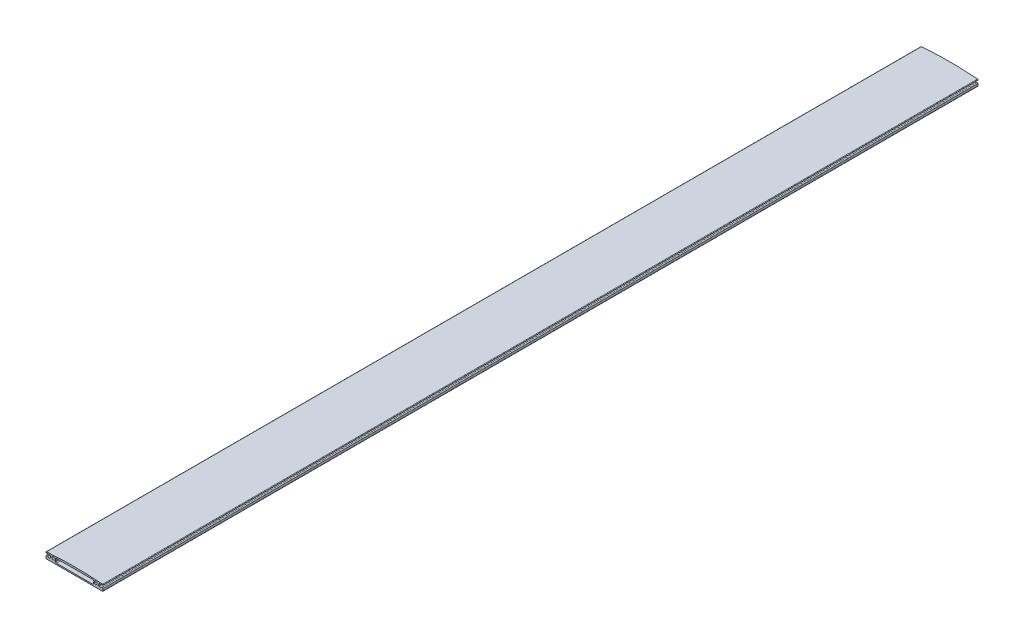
ISO-10303-21;
HEADER;
FILE_DESCRIPTION(('STEP AP214'),'2;1');
FILE_NAME('part.step','',(''),(''),'','','');
FILE_SCHEMA(('AUTOMOTIVE_DESIGN { 1 0 10303 214 1 1 1 1 }'));
ENDSEC;
DATA;
#1=APPLICATION_CONTEXT('core data for automotive mechanical design processes');
#2=APPLICATION_PROTOCOL_DEFINITION('international standard','automotive_design',2000,#1);
#3=PRODUCT_CONTEXT('',#1,'mechanical');
#4=PRODUCT('Part','Part','',(#3));
#5=PRODUCT_RELATED_PRODUCT_CATEGORY('part','',(#4));
#6=PRODUCT_DEFINITION_FORMATION('','',#4);
#7=PRODUCT_DEFINITION_CONTEXT('part definition',#1,'design');
#8=PRODUCT_DEFINITION('design','',#6,#7);
#9=PRODUCT_DEFINITION_SHAPE('','',#8);
#10=(LENGTH_UNIT() NAMED_UNIT(*) SI_UNIT(.MILLI.,.METRE.));
#11=(NAMED_UNIT(*) PLANE_ANGLE_UNIT() SI_UNIT($,.RADIAN.));
#12=(NAMED_UNIT(*) SI_UNIT($,.STERADIAN.) SOLID_ANGLE_UNIT());
#13=UNCERTAINTY_MEASURE_WITH_UNIT(LENGTH_MEASURE(1.E-05),#10,'distance_accuracy_value','');
#14=(GEOMETRIC_REPRESENTATION_CONTEXT(3) GLOBAL_UNCERTAINTY_ASSIGNED_CONTEXT((#13)) GLOBAL_UNIT_ASSIGNED_CONTEXT((#10,
#11,#12)) REPRESENTATION_CONTEXT('',''));
#15=CARTESIAN_POINT('',(0.,0.,0.));
#16=DIRECTION('',(0.,0.,1.));
#17=DIRECTION('',(1.,0.,0.));
#18=AXIS2_PLACEMENT_3D('',#15,#16,#17);
#19=CARTESIAN_POINT('',(32.4,-4.4,506.15));
#20=DIRECTION('',(0.,0.,-1.));
#21=DIRECTION('',(-1.,0.,0.));
#22=AXIS2_PLACEMENT_3D('',#19,#20,#21);
#23=PLANE('',#22);
#24=DIRECTION('',(1.,0.,0.));
#25=VECTOR('',#24,1.);
#26=CARTESIAN_POINT('',(-22.,-5.,506.15));
#27=LINE('',#26,#25);
#28=CARTESIAN_POINT('',(-32.4,-5.,506.15));
#29=VERTEX_POINT('',#28);
#30=CARTESIAN_POINT('',(32.4,-5.00000000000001,506.15));
#31=VERTEX_POINT('',#30);
#32=EDGE_CURVE('E317',#29,#31,#27,.T.);
#33=ORIENTED_EDGE('',*,*,#32,.T.);
#34=CARTESIAN_POINT('',(32.4,-4.4,506.15));
#35=DIRECTION('',(0.,0.,1.));
#36=DIRECTION('',(-1.,0.,0.));
#37=AXIS2_PLACEMENT_3D('',#34,#35,#36);
#38=CIRCLE('',#37,0.600000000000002);
#39=CARTESIAN_POINT('',(33.,-4.4,506.15));
#40=VERTEX_POINT('',#39);
#41=EDGE_CURVE('E319',#31,#40,#38,.T.);
#42=ORIENTED_EDGE('',*,*,#41,.T.);
#43=DIRECTION('',(0.,1.,0.));
#44=VECTOR('',#43,1.);
#45=CARTESIAN_POINT('',(33.,-4.4,506.15));
#46=LINE('',#45,#44);
#47=CARTESIAN_POINT('',(33.,-2.,506.15));
#48=VERTEX_POINT('',#47);
#49=EDGE_CURVE('E322',#40,#48,#46,.T.);
#50=ORIENTED_EDGE('',*,*,#49,.T.);
#51=CARTESIAN_POINT('',(32.25,-2.,506.15));
#52=DIRECTION('',(0.,0.,1.));
#53=DIRECTION('',(-1.,0.,0.));
#54=AXIS2_PLACEMENT_3D('',#51,#52,#53);
#55=CIRCLE('',#54,0.75);
#56=CARTESIAN_POINT('',(31.5626136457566,-1.7,506.15));
#57=VERTEX_POINT('',#56);
#58=EDGE_CURVE('E324',#48,#57,#55,.T.);
#59=ORIENTED_EDGE('',*,*,#58,.T.);
#60=CARTESIAN_POINT('',(31.104356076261,-1.5,506.15));
#61=DIRECTION('',(0.,0.,-1.));
#62=DIRECTION('',(-1.,0.,0.));
#63=AXIS2_PLACEMENT_3D('',#60,#61,#62);
#64=CIRCLE('',#63,0.500000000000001);
#65=CARTESIAN_POINT('',(31.104356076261,-2.,506.15));
#66=VERTEX_POINT('',#65);
#67=EDGE_CURVE('E326',#57,#66,#64,.T.);
#68=ORIENTED_EDGE('',*,*,#67,.T.);
#69=DIRECTION('',(-1.,0.,0.));
#70=VECTOR('',#69,1.);
#71=CARTESIAN_POINT('',(31.104356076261,-2.,506.15));
#72=LINE('',#71,#70);
#73=CARTESIAN_POINT('',(28.6,-2.,506.15));
#74=VERTEX_POINT('',#73);
#75=EDGE_CURVE('E328',#66,#74,#72,.T.);
#76=ORIENTED_EDGE('',*,*,#75,.T.);
#77=CARTESIAN_POINT('',(28.6,-1.4,506.15));
#78=DIRECTION('',(0.,0.,-1.));
#79=DIRECTION('',(1.,0.,0.));
#80=AXIS2_PLACEMENT_3D('',#77,#78,#79);
#81=CIRCLE('',#80,0.6);
#82=CARTESIAN_POINT('',(28.,-1.4,506.15));
#83=VERTEX_POINT('',#82);
#84=EDGE_CURVE('E330',#74,#83,#81,.T.);
#85=ORIENTED_EDGE('',*,*,#84,.T.);
#86=DIRECTION('',(0.,1.,0.));
#87=VECTOR('',#86,1.);
#88=CARTESIAN_POINT('',(28.,0.149999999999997,506.15));
#89=LINE('',#88,#87);
#90=CARTESIAN_POINT('',(28.,0.149999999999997,506.15));
#91=VERTEX_POINT('',#90);
#92=EDGE_CURVE('E332',#83,#91,#89,.T.);
#93=ORIENTED_EDGE('',*,*,#92,.T.);
#94=CARTESIAN_POINT('',(28.85,0.149999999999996,506.15));
#95=DIRECTION('',(0.,0.,-1.));
#96=DIRECTION('',(-1.,0.,0.));
#97=AXIS2_PLACEMENT_3D('',#94,#95,#96);
#98=CIRCLE('',#97,0.850000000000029);
#99=CARTESIAN_POINT('',(28.85,0.999999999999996,506.15));
#100=VERTEX_POINT('',#99);
#101=EDGE_CURVE('E334',#91,#100,#98,.T.);
#102=ORIENTED_EDGE('',*,*,#101,.T.);
#103=DIRECTION('',(1.,0.,0.));
#104=VECTOR('',#103,1.);
#105=CARTESIAN_POINT('',(32.3999999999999,0.999999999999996,506.15));
#106=LINE('',#105,#104);
#107=CARTESIAN_POINT('',(32.3999999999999,0.999999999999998,506.15));
#108=VERTEX_POINT('',#107);
#109=EDGE_CURVE('E336',#100,#108,#106,.T.);
#110=ORIENTED_EDGE('',*,*,#109,.T.);
#111=CARTESIAN_POINT('',(32.4,1.60048941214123,506.15));
#112=DIRECTION('',(0.,0.,1.));
#113=DIRECTION('',(1.,0.,0.));
#114=AXIS2_PLACEMENT_3D('',#111,#112,#113);
#115=CIRCLE('',#114,0.600489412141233);
#116=CARTESIAN_POINT('',(32.4484386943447,2.19902197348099,506.15));
#117=VERTEX_POINT('',#116);
#118=EDGE_CURVE('E338',#108,#117,#115,.T.);
#119=ORIENTED_EDGE('',*,*,#118,.T.);
#120=CARTESIAN_POINT('',(0.,-398.75,506.15));
#121=DIRECTION('',(0.,0.,1.));
#122=DIRECTION('',(-1.,0.,0.));
#123=AXIS2_PLACEMENT_3D('',#120,#121,#122);
#124=CIRCLE('',#123,402.259890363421);
#125=CARTESIAN_POINT('',(-32.4484386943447,2.19902197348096,506.15));
#126=VERTEX_POINT('',#125);
#127=EDGE_CURVE('E340',#117,#126,#124,.T.);
#128=ORIENTED_EDGE('',*,*,#127,.T.);
#129=CARTESIAN_POINT('',(-32.4,1.60048941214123,506.15));
#130=DIRECTION('',(0.,0.,1.));
#131=DIRECTION('',(-1.,0.,0.));
#132=AXIS2_PLACEMENT_3D('',#129,#130,#131);
#133=CIRCLE('',#132,0.600489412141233);
#134=CARTESIAN_POINT('',(-32.3999999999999,0.999999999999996,506.15));
#135=VERTEX_POINT('',#134);
#136=EDGE_CURVE('E342',#126,#135,#133,.T.);
#137=ORIENTED_EDGE('',*,*,#136,.T.);
#138=DIRECTION('',(1.,0.,0.));
#139=VECTOR('',#138,1.);
#140=CARTESIAN_POINT('',(-32.3999999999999,0.999999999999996,506.15));
#141=LINE('',#140,#139);
#142=CARTESIAN_POINT('',(-28.85,1.00000000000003,506.15));
#143=VERTEX_POINT('',#142);
#144=EDGE_CURVE('E344',#135,#143,#141,.T.);
#145=ORIENTED_EDGE('',*,*,#144,.T.);
#146=CARTESIAN_POINT('',(-28.85,0.149999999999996,506.15));
#147=DIRECTION('',(0.,0.,-1.));
#148=DIRECTION('',(1.,0.,0.));
#149=AXIS2_PLACEMENT_3D('',#146,#147,#148);
#150=CIRCLE('',#149,0.850000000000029);
#151=CARTESIAN_POINT('',(-28.,0.149999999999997,506.15));
#152=VERTEX_POINT('',#151);
#153=EDGE_CURVE('E346',#143,#152,#150,.T.);
#154=ORIENTED_EDGE('',*,*,#153,.T.);
#155=DIRECTION('',(0.,-1.,0.));
#156=VECTOR('',#155,1.);
#157=CARTESIAN_POINT('',(-28.,0.149999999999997,506.15));
#158=LINE('',#157,#156);
#159=CARTESIAN_POINT('',(-28.,-1.4,506.15));
#160=VERTEX_POINT('',#159);
#161=EDGE_CURVE('E348',#152,#160,#158,.T.);
#162=ORIENTED_EDGE('',*,*,#161,.T.);
#163=CARTESIAN_POINT('',(-28.6,-1.4,506.15));
#164=DIRECTION('',(0.,0.,-1.));
#165=DIRECTION('',(-1.,0.,0.));
#166=AXIS2_PLACEMENT_3D('',#163,#164,#165);
#167=CIRCLE('',#166,0.6);
#168=CARTESIAN_POINT('',(-28.6,-2.,506.15));
#169=VERTEX_POINT('',#168);
#170=EDGE_CURVE('E350',#160,#169,#167,.T.);
#171=ORIENTED_EDGE('',*,*,#170,.T.);
#172=DIRECTION('',(-1.,0.,0.));
#173=VECTOR('',#172,1.);
#174=CARTESIAN_POINT('',(-31.104356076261,-2.,506.15));
#175=LINE('',#174,#173);
#176=CARTESIAN_POINT('',(-31.104356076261,-2.,506.15));
#177=VERTEX_POINT('',#176);
#178=EDGE_CURVE('E352',#169,#177,#175,.T.);
#179=ORIENTED_EDGE('',*,*,#178,.T.);
#180=CARTESIAN_POINT('',(-31.104356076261,-1.5,506.15));
#181=DIRECTION('',(0.,0.,-1.));
#182=DIRECTION('',(1.,0.,0.));
#183=AXIS2_PLACEMENT_3D('',#180,#181,#182);
#184=CIRCLE('',#183,0.500000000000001);
#185=CARTESIAN_POINT('',(-31.5626136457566,-1.7,506.15));
#186=VERTEX_POINT('',#185);
#187=EDGE_CURVE('E354',#177,#186,#184,.T.);
#188=ORIENTED_EDGE('',*,*,#187,.T.);
#189=CARTESIAN_POINT('',(-32.25,-2.,506.15));
#190=DIRECTION('',(0.,0.,1.));
#191=DIRECTION('',(1.,0.,0.));
#192=AXIS2_PLACEMENT_3D('',#189,#190,#191);
#193=CIRCLE('',#192,0.75);
#194=CARTESIAN_POINT('',(-33.,-2.,506.15));
#195=VERTEX_POINT('',#194);
#196=EDGE_CURVE('E356',#186,#195,#193,.T.);
#197=ORIENTED_EDGE('',*,*,#196,.T.);
#198=DIRECTION('',(0.,-1.,0.));
#199=VECTOR('',#198,1.);
#200=CARTESIAN_POINT('',(-33.,-4.4,506.15));
#201=LINE('',#200,#199);
#202=CARTESIAN_POINT('',(-33.,-4.4,506.15));
#203=VERTEX_POINT('',#202);
#204=EDGE_CURVE('E358',#195,#203,#201,.T.);
#205=ORIENTED_EDGE('',*,*,#204,.T.);
#206=CARTESIAN_POINT('',(-32.4,-4.4,506.15));
#207=DIRECTION('',(0.,0.,1.));
#208=DIRECTION('',(1.,0.,0.));
#209=AXIS2_PLACEMENT_3D('',#206,#207,#208);
#210=CIRCLE('',#209,0.600000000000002);
#211=EDGE_CURVE('E360',#203,#29,#210,.T.);
#212=ORIENTED_EDGE('',*,*,#211,.T.);
#213=EDGE_LOOP('',(#33,#42,#50,#59,#68,#76,#85,#93,#102,#110,#119,#128,#137,#145,#154,#162,#171,
#179,#188,#197,#205,#212));
#214=FACE_BOUND('',#213,.T.);
#215=DIRECTION('',(0.,-1.,0.));
#216=VECTOR('',#215,1.);
#217=CARTESIAN_POINT('',(-22.,-2.50000000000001,506.15));
#218=LINE('',#217,#216);
#219=CARTESIAN_POINT('',(-22.,-1.,506.15));
#220=VERTEX_POINT('',#219);
#221=CARTESIAN_POINT('',(-22.,-2.50000000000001,506.15));
#222=VERTEX_POINT('',#221);
#223=EDGE_CURVE('E916',#220,#222,#218,.T.);
#224=ORIENTED_EDGE('',*,*,#223,.F.);
#225=DIRECTION('',(1.,0.,0.));
#226=VECTOR('',#225,1.);
#227=CARTESIAN_POINT('',(-23.0853950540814,-1.,506.15));
#228=LINE('',#227,#226);
#229=CARTESIAN_POINT('',(-23.0853950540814,-1.,506.15));
#230=VERTEX_POINT('',#229);
#231=EDGE_CURVE('E31',#230,#220,#228,.T.);
#232=ORIENTED_EDGE('',*,*,#231,.F.);
#233=CARTESIAN_POINT('',(-24.4987244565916,-0.250000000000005,506.15));
#234=DIRECTION('',(0.,0.,1.));
#235=DIRECTION('',(1.,0.,0.));
#236=AXIS2_PLACEMENT_3D('',#233,#234,#235);
#237=CIRCLE('',#236,1.6);
#238=CARTESIAN_POINT('',(-23.0853950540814,0.499999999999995,506.15));
#239=VERTEX_POINT('',#238);
#240=EDGE_CURVE('E909',#239,#230,#237,.T.);
#241=ORIENTED_EDGE('',*,*,#240,.F.);
#242=DIRECTION('',(-1.,0.,0.));
#243=VECTOR('',#242,1.);
#244=CARTESIAN_POINT('',(-23.0853950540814,0.499999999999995,506.15));
#245=LINE('',#244,#243);
#246=CARTESIAN_POINT('',(-21.9682458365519,0.499999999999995,506.15));
#247=VERTEX_POINT('',#246);
#248=EDGE_CURVE('E912',#247,#239,#245,.T.);
#249=ORIENTED_EDGE('',*,*,#248,.F.);
#250=CARTESIAN_POINT('',(-21.,0.249999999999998,506.15));
#251=DIRECTION('',(0.,0.,1.));
#252=DIRECTION('',(-1.,0.,0.));
#253=AXIS2_PLACEMENT_3D('',#250,#251,#252);
#254=CIRCLE('',#253,1.);
#255=CARTESIAN_POINT('',(-21.,1.25,506.15));
#256=VERTEX_POINT('',#255);
#257=EDGE_CURVE('E268',#256,#247,#254,.T.);
#258=ORIENTED_EDGE('',*,*,#257,.F.);
#259=DIRECTION('',(-1.,0.,0.));
#260=VECTOR('',#259,1.);
#261=CARTESIAN_POINT('',(-21.,1.25,506.15));
#262=LINE('',#261,#260);
#263=CARTESIAN_POINT('',(21.,1.25,506.15));
#264=VERTEX_POINT('',#263);
#265=EDGE_CURVE('E285',#264,#256,#262,.T.);
#266=ORIENTED_EDGE('',*,*,#265,.F.);
#267=CARTESIAN_POINT('',(21.,0.249999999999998,506.15));
#268=DIRECTION('',(0.,0.,1.));
#269=DIRECTION('',(1.,0.,0.));
#270=AXIS2_PLACEMENT_3D('',#267,#268,#269);
#271=CIRCLE('',#270,1.);
#272=CARTESIAN_POINT('',(21.9682458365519,0.499999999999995,506.15));
#273=VERTEX_POINT('',#272);
#274=EDGE_CURVE('E955',#273,#264,#271,.T.);
#275=ORIENTED_EDGE('',*,*,#274,.F.);
#276=DIRECTION('',(-1.,0.,0.));
#277=VECTOR('',#276,1.);
#278=CARTESIAN_POINT('',(23.0853950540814,0.499999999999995,506.15));
#279=LINE('',#278,#277);
#280=CARTESIAN_POINT('',(23.0853950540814,0.499999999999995,506.15));
#281=VERTEX_POINT('',#280);
#282=EDGE_CURVE('E39',#281,#273,#279,.T.);
#283=ORIENTED_EDGE('',*,*,#282,.F.);
#284=CARTESIAN_POINT('',(24.4987244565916,-0.250000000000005,506.15));
#285=DIRECTION('',(0.,0.,1.));
#286=DIRECTION('',(-1.,0.,0.));
#287=AXIS2_PLACEMENT_3D('',#284,#285,#286);
#288=CIRCLE('',#287,1.6);
#289=CARTESIAN_POINT('',(23.0853950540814,-1.00000000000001,506.15));
#290=VERTEX_POINT('',#289);
#291=EDGE_CURVE('E937',#290,#281,#288,.T.);
#292=ORIENTED_EDGE('',*,*,#291,.F.);
#293=DIRECTION('',(1.,0.,0.));
#294=VECTOR('',#293,1.);
#295=CARTESIAN_POINT('',(23.0853950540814,-1.,506.15));
#296=LINE('',#295,#294);
#297=CARTESIAN_POINT('',(22.,-1.,506.15));
#298=VERTEX_POINT('',#297);
#299=EDGE_CURVE('E922',#298,#290,#296,.T.);
#300=ORIENTED_EDGE('',*,*,#299,.F.);
#301=DIRECTION('',(0.,1.,0.));
#302=VECTOR('',#301,1.);
#303=CARTESIAN_POINT('',(22.,-2.5,506.15));
#304=LINE('',#303,#302);
#305=CARTESIAN_POINT('',(22.,-2.5,506.15));
#306=VERTEX_POINT('',#305);
#307=EDGE_CURVE('E953',#306,#298,#304,.T.);
#308=ORIENTED_EDGE('',*,*,#307,.F.);
#309=CARTESIAN_POINT('',(21.,-2.5,506.15));
#310=DIRECTION('',(0.,0.,1.));
#311=DIRECTION('',(-1.,0.,0.));
#312=AXIS2_PLACEMENT_3D('',#309,#310,#311);
#313=CIRCLE('',#312,1.);
#314=CARTESIAN_POINT('',(21.,-3.5,506.15));
#315=VERTEX_POINT('',#314);
#316=EDGE_CURVE('E951',#315,#306,#313,.T.);
#317=ORIENTED_EDGE('',*,*,#316,.F.);
#318=DIRECTION('',(1.,0.,0.));
#319=VECTOR('',#318,1.);
#320=CARTESIAN_POINT('',(21.,-3.5,506.15));
#321=LINE('',#320,#319);
#322=CARTESIAN_POINT('',(-21.,-3.50000000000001,506.15));
#323=VERTEX_POINT('',#322);
#324=EDGE_CURVE('E949',#323,#315,#321,.T.);
#325=ORIENTED_EDGE('',*,*,#324,.F.);
#326=CARTESIAN_POINT('',(-21.,-2.50000000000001,506.15));
#327=DIRECTION('',(0.,0.,1.));
#328=DIRECTION('',(-1.,0.,0.));
#329=AXIS2_PLACEMENT_3D('',#326,#327,#328);
#330=CIRCLE('',#329,1.);
#331=EDGE_CURVE('E947',#222,#323,#330,.T.);
#332=ORIENTED_EDGE('',*,*,#331,.F.);
#333=EDGE_LOOP('',(#224,#232,#241,#249,#258,#266,#275,#283,#292,#300,#308,#317,#325,#332));
#334=FACE_BOUND('',#333,.T.);
#335=ADVANCED_FACE('F16',(#214,#334),#23,.F.);
#336=CARTESIAN_POINT('',(32.4,-4.4,-506.15));
#337=DIRECTION('',(0.,0.,-1.));
#338=DIRECTION('',(-1.,0.,0.));
#339=AXIS2_PLACEMENT_3D('',#336,#337,#338);
#340=PLANE('',#339);
#341=DIRECTION('',(1.,0.,0.));
#342=VECTOR('',#341,1.);
#343=CARTESIAN_POINT('',(-23.0853950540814,-1.,-506.15));
#344=LINE('',#343,#342);
#345=CARTESIAN_POINT('',(-23.0853950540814,-1.,-506.15));
#346=VERTEX_POINT('',#345);
#347=CARTESIAN_POINT('',(-22.,-1.,-506.15));
#348=VERTEX_POINT('',#347);
#349=EDGE_CURVE('E269',#346,#348,#344,.T.);
#350=ORIENTED_EDGE('',*,*,#349,.T.);
#351=DIRECTION('',(0.,-1.,0.));
#352=VECTOR('',#351,1.);
#353=CARTESIAN_POINT('',(-22.,-2.50000000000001,-506.15));
#354=LINE('',#353,#352);
#355=CARTESIAN_POINT('',(-22.,-2.50000000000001,-506.15));
#356=VERTEX_POINT('',#355);
#357=EDGE_CURVE('E277',#348,#356,#354,.T.);
#358=ORIENTED_EDGE('',*,*,#357,.T.);
#359=CARTESIAN_POINT('',(-21.,-2.50000000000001,-506.15));
#360=DIRECTION('',(0.,0.,1.));
#361=DIRECTION('',(-1.,0.,0.));
#362=AXIS2_PLACEMENT_3D('',#359,#360,#361);
#363=CIRCLE('',#362,1.);
#364=CARTESIAN_POINT('',(-21.,-3.50000000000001,-506.15));
#365=VERTEX_POINT('',#364);
#366=EDGE_CURVE('E280',#356,#365,#363,.T.);
#367=ORIENTED_EDGE('',*,*,#366,.T.);
#368=DIRECTION('',(1.,0.,0.));
#369=VECTOR('',#368,1.);
#370=CARTESIAN_POINT('',(21.,-3.5,-506.15));
#371=LINE('',#370,#369);
#372=CARTESIAN_POINT('',(21.,-3.5,-506.15));
#373=VERTEX_POINT('',#372);
#374=EDGE_CURVE('E290',#365,#373,#371,.T.);
#375=ORIENTED_EDGE('',*,*,#374,.T.);
#376=CARTESIAN_POINT('',(21.,-2.5,-506.15));
#377=DIRECTION('',(0.,0.,1.));
#378=DIRECTION('',(-1.,0.,0.));
#379=AXIS2_PLACEMENT_3D('',#376,#377,#378);
#380=CIRCLE('',#379,1.);
#381=CARTESIAN_POINT('',(22.,-2.5,-506.15));
#382=VERTEX_POINT('',#381);
#383=EDGE_CURVE('E293',#373,#382,#380,.T.);
#384=ORIENTED_EDGE('',*,*,#383,.T.);
#385=DIRECTION('',(0.,1.,0.));
#386=VECTOR('',#385,1.);
#387=CARTESIAN_POINT('',(22.,-2.5,-506.15));
#388=LINE('',#387,#386);
#389=CARTESIAN_POINT('',(22.,-1.,-506.15));
#390=VERTEX_POINT('',#389);
#391=EDGE_CURVE('E296',#382,#390,#388,.T.);
#392=ORIENTED_EDGE('',*,*,#391,.T.);
#393=DIRECTION('',(1.,0.,0.));
#394=VECTOR('',#393,1.);
#395=CARTESIAN_POINT('',(23.0853950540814,-1.,-506.15));
#396=LINE('',#395,#394);
#397=CARTESIAN_POINT('',(23.0853950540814,-1.00000000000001,-506.15));
#398=VERTEX_POINT('',#397);
#399=EDGE_CURVE('E925',#390,#398,#396,.T.);
#400=ORIENTED_EDGE('',*,*,#399,.T.);
#401=CARTESIAN_POINT('',(24.4987244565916,-0.250000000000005,-506.15));
#402=DIRECTION('',(0.,0.,1.));
#403=DIRECTION('',(-1.,0.,0.));
#404=AXIS2_PLACEMENT_3D('',#401,#402,#403);
#405=CIRCLE('',#404,1.6);
#406=CARTESIAN_POINT('',(23.0853950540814,0.499999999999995,-506.15));
#407=VERTEX_POINT('',#406);
#408=EDGE_CURVE('E928',#398,#407,#405,.T.);
#409=ORIENTED_EDGE('',*,*,#408,.T.);
#410=DIRECTION('',(-1.,0.,0.));
#411=VECTOR('',#410,1.);
#412=CARTESIAN_POINT('',(23.0853950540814,0.499999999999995,-506.15));
#413=LINE('',#412,#411);
#414=CARTESIAN_POINT('',(21.9682458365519,0.499999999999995,-506.15));
#415=VERTEX_POINT('',#414);
#416=EDGE_CURVE('E931',#407,#415,#413,.T.);
#417=ORIENTED_EDGE('',*,*,#416,.T.);
#418=CARTESIAN_POINT('',(21.,0.249999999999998,-506.15));
#419=DIRECTION('',(0.,0.,1.));
#420=DIRECTION('',(1.,0.,0.));
#421=AXIS2_PLACEMENT_3D('',#418,#419,#420);
#422=CIRCLE('',#421,1.);
#423=CARTESIAN_POINT('',(21.,1.25,-506.15));
#424=VERTEX_POINT('',#423);
#425=EDGE_CURVE('E299',#415,#424,#422,.T.);
#426=ORIENTED_EDGE('',*,*,#425,.T.);
#427=DIRECTION('',(-1.,0.,0.));
#428=VECTOR('',#427,1.);
#429=CARTESIAN_POINT('',(-21.,1.25,-506.15));
#430=LINE('',#429,#428);
#431=CARTESIAN_POINT('',(-21.,1.25,-506.15));
#432=VERTEX_POINT('',#431);
#433=EDGE_CURVE('E276',#424,#432,#430,.T.);
#434=ORIENTED_EDGE('',*,*,#433,.T.);
#435=CARTESIAN_POINT('',(-21.,0.249999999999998,-506.15));
#436=DIRECTION('',(0.,0.,1.));
#437=DIRECTION('',(-1.,0.,0.));
#438=AXIS2_PLACEMENT_3D('',#435,#436,#437);
#439=CIRCLE('',#438,1.);
#440=CARTESIAN_POINT('',(-21.9682458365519,0.499999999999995,-506.15));
#441=VERTEX_POINT('',#440);
#442=EDGE_CURVE('E265',#432,#441,#439,.T.);
#443=ORIENTED_EDGE('',*,*,#442,.T.);
#444=DIRECTION('',(-1.,0.,0.));
#445=VECTOR('',#444,1.);
#446=CARTESIAN_POINT('',(-23.0853950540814,0.499999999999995,-506.15));
#447=LINE('',#446,#445);
#448=CARTESIAN_POINT('',(-23.0853950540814,0.499999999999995,-506.15));
#449=VERTEX_POINT('',#448);
#450=EDGE_CURVE('E248',#441,#449,#447,.T.);
#451=ORIENTED_EDGE('',*,*,#450,.T.);
#452=CARTESIAN_POINT('',(-24.4987244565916,-0.250000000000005,-506.15));
#453=DIRECTION('',(0.,0.,1.));
#454=DIRECTION('',(1.,0.,0.));
#455=AXIS2_PLACEMENT_3D('',#452,#453,#454);
#456=CIRCLE('',#455,1.6);
#457=EDGE_CURVE('E259',#449,#346,#456,.T.);
#458=ORIENTED_EDGE('',*,*,#457,.T.);
#459=EDGE_LOOP('',(#350,#358,#367,#375,#384,#392,#400,#409,#417,#426,#434,#443,#451,#458));
#460=FACE_BOUND('',#459,.T.);
#461=CARTESIAN_POINT('',(32.4,-4.4,-506.15));
#462=DIRECTION('',(0.,0.,1.));
#463=DIRECTION('',(-1.,0.,0.));
#464=AXIS2_PLACEMENT_3D('',#461,#462,#463);
#465=CIRCLE('',#464,0.600000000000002);
#466=CARTESIAN_POINT('',(32.4,-5.00000000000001,-506.15));
#467=VERTEX_POINT('',#466);
#468=CARTESIAN_POINT('',(33.,-4.4,-506.15));
#469=VERTEX_POINT('',#468);
#470=EDGE_CURVE('E316',#467,#469,#465,.T.);
#471=ORIENTED_EDGE('',*,*,#470,.F.);
#472=DIRECTION('',(1.,0.,0.));
#473=VECTOR('',#472,1.);
#474=CARTESIAN_POINT('',(-22.,-5.,-506.15));
#475=LINE('',#474,#473);
#476=CARTESIAN_POINT('',(-32.4,-5.,-506.15));
#477=VERTEX_POINT('',#476);
#478=EDGE_CURVE('E320',#477,#467,#475,.T.);
#479=ORIENTED_EDGE('',*,*,#478,.F.);
#480=CARTESIAN_POINT('',(-32.4,-4.4,-506.15));
#481=DIRECTION('',(0.,0.,1.));
#482=DIRECTION('',(1.,0.,0.));
#483=AXIS2_PLACEMENT_3D('',#480,#481,#482);
#484=CIRCLE('',#483,0.600000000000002);
#485=CARTESIAN_POINT('',(-33.,-4.4,-506.15));
#486=VERTEX_POINT('',#485);
#487=EDGE_CURVE('E403',#486,#477,#484,.T.);
#488=ORIENTED_EDGE('',*,*,#487,.F.);
#489=DIRECTION('',(0.,-1.,0.));
#490=VECTOR('',#489,1.);
#491=CARTESIAN_POINT('',(-33.,-4.4,-506.15));
#492=LINE('',#491,#490);
#493=CARTESIAN_POINT('',(-33.,-2.,-506.15));
#494=VERTEX_POINT('',#493);
#495=EDGE_CURVE('E401',#494,#486,#492,.T.);
#496=ORIENTED_EDGE('',*,*,#495,.F.);
#497=CARTESIAN_POINT('',(-32.25,-2.,-506.15));
#498=DIRECTION('',(0.,0.,1.));
#499=DIRECTION('',(1.,0.,0.));
#500=AXIS2_PLACEMENT_3D('',#497,#498,#499);
#501=CIRCLE('',#500,0.75);
#502=CARTESIAN_POINT('',(-31.5626136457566,-1.7,-506.15));
#503=VERTEX_POINT('',#502);
#504=EDGE_CURVE('E399',#503,#494,#501,.T.);
#505=ORIENTED_EDGE('',*,*,#504,.F.);
#506=CARTESIAN_POINT('',(-31.104356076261,-1.5,-506.15));
#507=DIRECTION('',(0.,0.,-1.));
#508=DIRECTION('',(1.,0.,0.));
#509=AXIS2_PLACEMENT_3D('',#506,#507,#508);
#510=CIRCLE('',#509,0.500000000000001);
#511=CARTESIAN_POINT('',(-31.104356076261,-2.,-506.15));
#512=VERTEX_POINT('',#511);
#513=EDGE_CURVE('E397',#512,#503,#510,.T.);
#514=ORIENTED_EDGE('',*,*,#513,.F.);
#515=DIRECTION('',(-1.,0.,0.));
#516=VECTOR('',#515,1.);
#517=CARTESIAN_POINT('',(-31.104356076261,-2.,-506.15));
#518=LINE('',#517,#516);
#519=CARTESIAN_POINT('',(-28.6,-2.,-506.15));
#520=VERTEX_POINT('',#519);
#521=EDGE_CURVE('E395',#520,#512,#518,.T.);
#522=ORIENTED_EDGE('',*,*,#521,.F.);
#523=CARTESIAN_POINT('',(-28.6,-1.4,-506.15));
#524=DIRECTION('',(0.,0.,-1.));
#525=DIRECTION('',(-1.,0.,0.));
#526=AXIS2_PLACEMENT_3D('',#523,#524,#525);
#527=CIRCLE('',#526,0.6);
#528=CARTESIAN_POINT('',(-28.,-1.4,-506.15));
#529=VERTEX_POINT('',#528);
#530=EDGE_CURVE('E393',#529,#520,#527,.T.);
#531=ORIENTED_EDGE('',*,*,#530,.F.);
#532=DIRECTION('',(0.,-1.,0.));
#533=VECTOR('',#532,1.);
#534=CARTESIAN_POINT('',(-28.,0.149999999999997,-506.15));
#535=LINE('',#534,#533);
#536=CARTESIAN_POINT('',(-28.,0.149999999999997,-506.15));
#537=VERTEX_POINT('',#536);
#538=EDGE_CURVE('E391',#537,#529,#535,.T.);
#539=ORIENTED_EDGE('',*,*,#538,.F.);
#540=CARTESIAN_POINT('',(-28.85,0.149999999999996,-506.15));
#541=DIRECTION('',(0.,0.,-1.));
#542=DIRECTION('',(1.,0.,0.));
#543=AXIS2_PLACEMENT_3D('',#540,#541,#542);
#544=CIRCLE('',#543,0.850000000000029);
#545=CARTESIAN_POINT('',(-28.85,1.00000000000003,-506.15));
#546=VERTEX_POINT('',#545);
#547=EDGE_CURVE('E389',#546,#537,#544,.T.);
#548=ORIENTED_EDGE('',*,*,#547,.F.);
#549=DIRECTION('',(1.,0.,0.));
#550=VECTOR('',#549,1.);
#551=CARTESIAN_POINT('',(-32.3999999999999,0.999999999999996,-506.15));
#552=LINE('',#551,#550);
#553=CARTESIAN_POINT('',(-32.3999999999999,0.999999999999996,-506.15));
#554=VERTEX_POINT('',#553);
#555=EDGE_CURVE('E387',#554,#546,#552,.T.);
#556=ORIENTED_EDGE('',*,*,#555,.F.);
#557=CARTESIAN_POINT('',(-32.4,1.60048941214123,-506.15));
#558=DIRECTION('',(0.,0.,1.));
#559=DIRECTION('',(-1.,0.,0.));
#560=AXIS2_PLACEMENT_3D('',#557,#558,#559);
#561=CIRCLE('',#560,0.600489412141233);
#562=CARTESIAN_POINT('',(-32.4484386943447,2.19902197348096,-506.15));
#563=VERTEX_POINT('',#562);
#564=EDGE_CURVE('E385',#563,#554,#561,.T.);
#565=ORIENTED_EDGE('',*,*,#564,.F.);
#566=CARTESIAN_POINT('',(0.,-398.75,-506.15));
#567=DIRECTION('',(0.,0.,1.));
#568=DIRECTION('',(-1.,0.,0.));
#569=AXIS2_PLACEMENT_3D('',#566,#567,#568);
#570=CIRCLE('',#569,402.259890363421);
#571=CARTESIAN_POINT('',(32.4484386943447,2.19902197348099,-506.15));
#572=VERTEX_POINT('',#571);
#573=EDGE_CURVE('E383',#572,#563,#570,.T.);
#574=ORIENTED_EDGE('',*,*,#573,.F.);
#575=CARTESIAN_POINT('',(32.4,1.60048941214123,-506.15));
#576=DIRECTION('',(0.,0.,1.));
#577=DIRECTION('',(1.,0.,0.));
#578=AXIS2_PLACEMENT_3D('',#575,#576,#577);
#579=CIRCLE('',#578,0.600489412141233);
#580=CARTESIAN_POINT('',(32.3999999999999,0.999999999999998,-506.15));
#581=VERTEX_POINT('',#580);
#582=EDGE_CURVE('E381',#581,#572,#579,.T.);
#583=ORIENTED_EDGE('',*,*,#582,.F.);
#584=DIRECTION('',(1.,0.,0.));
#585=VECTOR('',#584,1.);
#586=CARTESIAN_POINT('',(32.3999999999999,0.999999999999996,-506.15));
#587=LINE('',#586,#585);
#588=CARTESIAN_POINT('',(28.85,0.999999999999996,-506.15));
#589=VERTEX_POINT('',#588);
#590=EDGE_CURVE('E379',#589,#581,#587,.T.);
#591=ORIENTED_EDGE('',*,*,#590,.F.);
#592=CARTESIAN_POINT('',(28.85,0.149999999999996,-506.15));
#593=DIRECTION('',(0.,0.,-1.));
#594=DIRECTION('',(-1.,0.,0.));
#595=AXIS2_PLACEMENT_3D('',#592,#593,#594);
#596=CIRCLE('',#595,0.850000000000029);
#597=CARTESIAN_POINT('',(28.,0.149999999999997,-506.15));
#598=VERTEX_POINT('',#597);
#599=EDGE_CURVE('E377',#598,#589,#596,.T.);
#600=ORIENTED_EDGE('',*,*,#599,.F.);
#601=DIRECTION('',(0.,1.,0.));
#602=VECTOR('',#601,1.);
#603=CARTESIAN_POINT('',(28.,0.149999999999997,-506.15));
#604=LINE('',#603,#602);
#605=CARTESIAN_POINT('',(28.,-1.4,-506.15));
#606=VERTEX_POINT('',#605);
#607=EDGE_CURVE('E375',#606,#598,#604,.T.);
#608=ORIENTED_EDGE('',*,*,#607,.F.);
#609=CARTESIAN_POINT('',(28.6,-1.4,-506.15));
#610=DIRECTION('',(0.,0.,-1.));
#611=DIRECTION('',(1.,0.,0.));
#612=AXIS2_PLACEMENT_3D('',#609,#610,#611);
#613=CIRCLE('',#612,0.6);
#614=CARTESIAN_POINT('',(28.6,-2.,-506.15));
#615=VERTEX_POINT('',#614);
#616=EDGE_CURVE('E373',#615,#606,#613,.T.);
#617=ORIENTED_EDGE('',*,*,#616,.F.);
#618=DIRECTION('',(-1.,0.,0.));
#619=VECTOR('',#618,1.);
#620=CARTESIAN_POINT('',(31.104356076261,-2.,-506.15));
#621=LINE('',#620,#619);
#622=CARTESIAN_POINT('',(31.104356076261,-2.,-506.15));
#623=VERTEX_POINT('',#622);
#624=EDGE_CURVE('E371',#623,#615,#621,.T.);
#625=ORIENTED_EDGE('',*,*,#624,.F.);
#626=CARTESIAN_POINT('',(31.104356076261,-1.5,-506.15));
#627=DIRECTION('',(0.,0.,-1.));
#628=DIRECTION('',(-1.,0.,0.));
#629=AXIS2_PLACEMENT_3D('',#626,#627,#628);
#630=CIRCLE('',#629,0.500000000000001);
#631=CARTESIAN_POINT('',(31.5626136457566,-1.7,-506.15));
#632=VERTEX_POINT('',#631);
#633=EDGE_CURVE('E369',#632,#623,#630,.T.);
#634=ORIENTED_EDGE('',*,*,#633,.F.);
#635=CARTESIAN_POINT('',(32.25,-2.,-506.15));
#636=DIRECTION('',(0.,0.,1.));
#637=DIRECTION('',(-1.,0.,0.));
#638=AXIS2_PLACEMENT_3D('',#635,#636,#637);
#639=CIRCLE('',#638,0.75);
#640=CARTESIAN_POINT('',(33.,-2.,-506.15));
#641=VERTEX_POINT('',#640);
#642=EDGE_CURVE('E367',#641,#632,#639,.T.);
#643=ORIENTED_EDGE('',*,*,#642,.F.);
#644=DIRECTION('',(0.,1.,0.));
#645=VECTOR('',#644,1.);
#646=CARTESIAN_POINT('',(33.,-4.4,-506.15));
#647=LINE('',#646,#645);
#648=EDGE_CURVE('E365',#469,#641,#647,.T.);
#649=ORIENTED_EDGE('',*,*,#648,.F.);
#650=EDGE_LOOP('',(#471,#479,#488,#496,#505,#514,#522,#531,#539,#548,#556,#565,#574,#583,#591,
#600,#608,#617,#625,#634,#643,#649));
#651=FACE_BOUND('',#650,.T.);
#652=ADVANCED_FACE('F273',(#460,#651),#340,.T.);
#653=CARTESIAN_POINT('',(32.4,-4.4,506.15));
#654=DIRECTION('',(0.,0.,-1.));
#655=DIRECTION('',(-1.,0.,0.));
#656=AXIS2_PLACEMENT_3D('',#653,#654,#655);
#657=CYLINDRICAL_SURFACE('',#656,0.600000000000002);
#658=ORIENTED_EDGE('',*,*,#470,.T.);
#659=DIRECTION('',(0.,0.,-1.));
#660=VECTOR('',#659,1.);
#661=CARTESIAN_POINT('',(33.,-4.4,506.15));
#662=LINE('',#661,#660);
#663=EDGE_CURVE('E24',#40,#469,#662,.T.);
#664=ORIENTED_EDGE('',*,*,#663,.F.);
#665=ORIENTED_EDGE('',*,*,#41,.F.);
#666=DIRECTION('',(0.,0.,-1.));
#667=VECTOR('',#666,1.);
#668=CARTESIAN_POINT('',(32.4,-5.00000000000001,506.15));
#669=LINE('',#668,#667);
#670=EDGE_CURVE('E10',#31,#467,#669,.T.);
#671=ORIENTED_EDGE('',*,*,#670,.T.);
#672=EDGE_LOOP('',(#658,#664,#665,#671));
#673=FACE_BOUND('',#672,.T.);
#674=ADVANCED_FACE('F18',(#673),#657,.T.);
#675=CARTESIAN_POINT('',(33.,-4.4,506.15));
#676=DIRECTION('',(-1.,0.,0.));
#677=DIRECTION('',(0.,-1.,0.));
#678=AXIS2_PLACEMENT_3D('',#675,#676,#677);
#679=PLANE('',#678);
#680=ORIENTED_EDGE('',*,*,#648,.T.);
#681=DIRECTION('',(0.,0.,-1.));
#682=VECTOR('',#681,1.);
#683=CARTESIAN_POINT('',(33.,-2.,506.15));
#684=LINE('',#683,#682);
#685=EDGE_CURVE('E462',#48,#641,#684,.T.);
#686=ORIENTED_EDGE('',*,*,#685,.F.);
#687=ORIENTED_EDGE('',*,*,#49,.F.);
#688=ORIENTED_EDGE('',*,*,#663,.T.);
#689=EDGE_LOOP('',(#680,#686,#687,#688));
#690=FACE_BOUND('',#689,.T.);
#691=ADVANCED_FACE('F469',(#690),#679,.F.);
#692=CARTESIAN_POINT('',(32.25,-2.,506.15));
#693=DIRECTION('',(0.,0.,-1.));
#694=DIRECTION('',(-1.,0.,0.));
#695=AXIS2_PLACEMENT_3D('',#692,#693,#694);
#696=CYLINDRICAL_SURFACE('',#695,0.75);
#697=ORIENTED_EDGE('',*,*,#642,.T.);
#698=DIRECTION('',(0.,0.,-1.));
#699=VECTOR('',#698,1.);
#700=CARTESIAN_POINT('',(31.5626136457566,-1.7,506.15));
#701=LINE('',#700,#699);
#702=EDGE_CURVE('E459',#57,#632,#701,.T.);
#703=ORIENTED_EDGE('',*,*,#702,.F.);
#704=ORIENTED_EDGE('',*,*,#58,.F.);
#705=ORIENTED_EDGE('',*,*,#685,.T.);
#706=EDGE_LOOP('',(#697,#703,#704,#705));
#707=FACE_BOUND('',#706,.T.);
#708=ADVANCED_FACE('F480',(#707),#696,.T.);
#709=CARTESIAN_POINT('',(31.104356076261,-1.5,506.15));
#710=DIRECTION('',(0.,0.,-1.));
#711=DIRECTION('',(-1.,0.,0.));
#712=AXIS2_PLACEMENT_3D('',#709,#710,#711);
#713=CYLINDRICAL_SURFACE('',#712,0.500000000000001);
#714=ORIENTED_EDGE('',*,*,#633,.T.);
#715=DIRECTION('',(0.,0.,-1.));
#716=VECTOR('',#715,1.);
#717=CARTESIAN_POINT('',(31.104356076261,-2.,506.15));
#718=LINE('',#717,#716);
#719=EDGE_CURVE('E456',#66,#623,#718,.T.);
#720=ORIENTED_EDGE('',*,*,#719,.F.);
#721=ORIENTED_EDGE('',*,*,#67,.F.);
#722=ORIENTED_EDGE('',*,*,#702,.T.);
#723=EDGE_LOOP('',(#714,#720,#721,#722));
#724=FACE_BOUND('',#723,.T.);
#725=ADVANCED_FACE('F484',(#724),#713,.F.);
#726=CARTESIAN_POINT('',(31.104356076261,-2.,506.15));
#727=DIRECTION('',(0.,-1.,0.));
#728=DIRECTION('',(1.,0.,0.));
#729=AXIS2_PLACEMENT_3D('',#726,#727,#728);
#730=PLANE('',#729);
#731=ORIENTED_EDGE('',*,*,#624,.T.);
#732=DIRECTION('',(0.,0.,-1.));
#733=VECTOR('',#732,1.);
#734=CARTESIAN_POINT('',(28.6,-2.,506.15));
#735=LINE('',#734,#733);
#736=EDGE_CURVE('E453',#74,#615,#735,.T.);
#737=ORIENTED_EDGE('',*,*,#736,.F.);
#738=ORIENTED_EDGE('',*,*,#75,.F.);
#739=ORIENTED_EDGE('',*,*,#719,.T.);
#740=EDGE_LOOP('',(#731,#737,#738,#739));
#741=FACE_BOUND('',#740,.T.);
#742=ADVANCED_FACE('F574',(#741),#730,.F.);
#743=CARTESIAN_POINT('',(28.6,-1.4,506.15));
#744=DIRECTION('',(0.,0.,-1.));
#745=DIRECTION('',(-1.,0.,0.));
#746=AXIS2_PLACEMENT_3D('',#743,#744,#745);
#747=CYLINDRICAL_SURFACE('',#746,0.6);
#748=ORIENTED_EDGE('',*,*,#616,.T.);
#749=DIRECTION('',(0.,0.,-1.));
#750=VECTOR('',#749,1.);
#751=CARTESIAN_POINT('',(28.,-1.4,506.15));
#752=LINE('',#751,#750);
#753=EDGE_CURVE('E450',#83,#606,#752,.T.);
#754=ORIENTED_EDGE('',*,*,#753,.F.);
#755=ORIENTED_EDGE('',*,*,#84,.F.);
#756=ORIENTED_EDGE('',*,*,#736,.T.);
#757=EDGE_LOOP('',(#748,#754,#755,#756));
#758=FACE_BOUND('',#757,.T.);
#759=ADVANCED_FACE('F571',(#758),#747,.F.);
#760=CARTESIAN_POINT('',(28.,0.149999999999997,506.15));
#761=DIRECTION('',(-1.,0.,0.));
#762=DIRECTION('',(0.,-1.,0.));
#763=AXIS2_PLACEMENT_3D('',#760,#761,#762);
#764=PLANE('',#763);
#765=ORIENTED_EDGE('',*,*,#607,.T.);
#766=DIRECTION('',(0.,0.,-1.));
#767=VECTOR('',#766,1.);
#768=CARTESIAN_POINT('',(28.,0.149999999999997,506.15));
#769=LINE('',#768,#767);
#770=EDGE_CURVE('E447',#91,#598,#769,.T.);
#771=ORIENTED_EDGE('',*,*,#770,.F.);
#772=ORIENTED_EDGE('',*,*,#92,.F.);
#773=ORIENTED_EDGE('',*,*,#753,.T.);
#774=EDGE_LOOP('',(#765,#771,#772,#773));
#775=FACE_BOUND('',#774,.T.);
#776=ADVANCED_FACE('F567',(#775),#764,.F.);
#777=CARTESIAN_POINT('',(28.85,0.149999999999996,506.15));
#778=DIRECTION('',(0.,0.,-1.));
#779=DIRECTION('',(-1.,0.,0.));
#780=AXIS2_PLACEMENT_3D('',#777,#778,#779);
#781=CYLINDRICAL_SURFACE('',#780,0.850000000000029);
#782=ORIENTED_EDGE('',*,*,#599,.T.);
#783=DIRECTION('',(0.,0.,-1.));
#784=VECTOR('',#783,1.);
#785=CARTESIAN_POINT('',(28.85,0.999999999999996,506.15));
#786=LINE('',#785,#784);
#787=EDGE_CURVE('E444',#100,#589,#786,.T.);
#788=ORIENTED_EDGE('',*,*,#787,.F.);
#789=ORIENTED_EDGE('',*,*,#101,.F.);
#790=ORIENTED_EDGE('',*,*,#770,.T.);
#791=EDGE_LOOP('',(#782,#788,#789,#790));
#792=FACE_BOUND('',#791,.T.);
#793=ADVANCED_FACE('F563',(#792),#781,.F.);
#794=CARTESIAN_POINT('',(32.3999999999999,0.999999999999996,506.15));
#795=DIRECTION('',(0.,1.,0.));
#796=DIRECTION('',(0.,0.,1.));
#797=AXIS2_PLACEMENT_3D('',#794,#795,#796);
#798=PLANE('',#797);
#799=ORIENTED_EDGE('',*,*,#590,.T.);
#800=DIRECTION('',(0.,0.,-1.));
#801=VECTOR('',#800,1.);
#802=CARTESIAN_POINT('',(32.3999999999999,0.999999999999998,506.15));
#803=LINE('',#802,#801);
#804=EDGE_CURVE('E441',#108,#581,#803,.T.);
#805=ORIENTED_EDGE('',*,*,#804,.F.);
#806=ORIENTED_EDGE('',*,*,#109,.F.);
#807=ORIENTED_EDGE('',*,*,#787,.T.);
#808=EDGE_LOOP('',(#799,#805,#806,#807));
#809=FACE_BOUND('',#808,.T.);
#810=ADVANCED_FACE('F558',(#809),#798,.F.);
#811=CARTESIAN_POINT('',(32.4,1.60048941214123,506.15));
#812=DIRECTION('',(0.,0.,-1.));
#813=DIRECTION('',(-1.,0.,0.));
#814=AXIS2_PLACEMENT_3D('',#811,#812,#813);
#815=CYLINDRICAL_SURFACE('',#814,0.600489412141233);
#816=ORIENTED_EDGE('',*,*,#582,.T.);
#817=DIRECTION('',(0.,0.,-1.));
#818=VECTOR('',#817,1.);
#819=CARTESIAN_POINT('',(32.4484386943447,2.19902197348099,506.15));
#820=LINE('',#819,#818);
#821=EDGE_CURVE('E438',#117,#572,#820,.T.);
#822=ORIENTED_EDGE('',*,*,#821,.F.);
#823=ORIENTED_EDGE('',*,*,#118,.F.);
#824=ORIENTED_EDGE('',*,*,#804,.T.);
#825=EDGE_LOOP('',(#816,#822,#823,#824));
#826=FACE_BOUND('',#825,.T.);
#827=ADVANCED_FACE('F552',(#826),#815,.T.);
#828=CARTESIAN_POINT('',(0.,-398.75,506.15));
#829=DIRECTION('',(0.,0.,-1.));
#830=DIRECTION('',(-1.,0.,0.));
#831=AXIS2_PLACEMENT_3D('',#828,#829,#830);
#832=CYLINDRICAL_SURFACE('',#831,402.259890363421);
#833=ORIENTED_EDGE('',*,*,#573,.T.);
#834=DIRECTION('',(0.,0.,-1.));
#835=VECTOR('',#834,1.);
#836=CARTESIAN_POINT('',(-32.4484386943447,2.19902197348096,506.15));
#837=LINE('',#836,#835);
#838=EDGE_CURVE('E435',#126,#563,#837,.T.);
#839=ORIENTED_EDGE('',*,*,#838,.F.);
#840=ORIENTED_EDGE('',*,*,#127,.F.);
#841=ORIENTED_EDGE('',*,*,#821,.T.);
#842=EDGE_LOOP('',(#833,#839,#840,#841));
#843=FACE_BOUND('',#842,.T.);
#844=ADVANCED_FACE('F548',(#843),#832,.T.);
#845=CARTESIAN_POINT('',(-32.4,1.60048941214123,506.15));
#846=DIRECTION('',(0.,0.,-1.));
#847=DIRECTION('',(-1.,0.,0.));
#848=AXIS2_PLACEMENT_3D('',#845,#846,#847);
#849=CYLINDRICAL_SURFACE('',#848,0.600489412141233);
#850=ORIENTED_EDGE('',*,*,#564,.T.);
#851=DIRECTION('',(0.,0.,-1.));
#852=VECTOR('',#851,1.);
#853=CARTESIAN_POINT('',(-32.3999999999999,0.999999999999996,506.15));
#854=LINE('',#853,#852);
#855=EDGE_CURVE('E432',#135,#554,#854,.T.);
#856=ORIENTED_EDGE('',*,*,#855,.F.);
#857=ORIENTED_EDGE('',*,*,#136,.F.);
#858=ORIENTED_EDGE('',*,*,#838,.T.);
#859=EDGE_LOOP('',(#850,#856,#857,#858));
#860=FACE_BOUND('',#859,.T.);
#861=ADVANCED_FACE('F543',(#860),#849,.T.);
#862=CARTESIAN_POINT('',(-32.3999999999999,0.999999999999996,506.15));
#863=DIRECTION('',(0.,1.,0.));
#864=DIRECTION('',(0.,0.,1.));
#865=AXIS2_PLACEMENT_3D('',#862,#863,#864);
#866=PLANE('',#865);
#867=ORIENTED_EDGE('',*,*,#555,.T.);
#868=DIRECTION('',(0.,0.,-1.));
#869=VECTOR('',#868,1.);
#870=CARTESIAN_POINT('',(-28.85,1.00000000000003,506.15));
#871=LINE('',#870,#869);
#872=EDGE_CURVE('E429',#143,#546,#871,.T.);
#873=ORIENTED_EDGE('',*,*,#872,.F.);
#874=ORIENTED_EDGE('',*,*,#144,.F.);
#875=ORIENTED_EDGE('',*,*,#855,.T.);
#876=EDGE_LOOP('',(#867,#873,#874,#875));
#877=FACE_BOUND('',#876,.T.);
#878=ADVANCED_FACE('F537',(#877),#866,.F.);
#879=CARTESIAN_POINT('',(-28.85,0.149999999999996,506.15));
#880=DIRECTION('',(0.,0.,-1.));
#881=DIRECTION('',(-1.,0.,0.));
#882=AXIS2_PLACEMENT_3D('',#879,#880,#881);
#883=CYLINDRICAL_SURFACE('',#882,0.850000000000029);
#884=ORIENTED_EDGE('',*,*,#547,.T.);
#885=DIRECTION('',(0.,0.,-1.));
#886=VECTOR('',#885,1.);
#887=CARTESIAN_POINT('',(-28.,0.149999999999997,506.15));
#888=LINE('',#887,#886);
#889=EDGE_CURVE('E426',#152,#537,#888,.T.);
#890=ORIENTED_EDGE('',*,*,#889,.F.);
#891=ORIENTED_EDGE('',*,*,#153,.F.);
#892=ORIENTED_EDGE('',*,*,#872,.T.);
#893=EDGE_LOOP('',(#884,#890,#891,#892));
#894=FACE_BOUND('',#893,.T.);
#895=ADVANCED_FACE('F533',(#894),#883,.F.);
#896=CARTESIAN_POINT('',(-28.,0.149999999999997,506.15));
#897=DIRECTION('',(1.,0.,0.));
#898=DIRECTION('',(0.,1.,0.));
#899=AXIS2_PLACEMENT_3D('',#896,#897,#898);
#900=PLANE('',#899);
#901=ORIENTED_EDGE('',*,*,#538,.T.);
#902=DIRECTION('',(0.,0.,-1.));
#903=VECTOR('',#902,1.);
#904=CARTESIAN_POINT('',(-28.,-1.4,506.15));
#905=LINE('',#904,#903);
#906=EDGE_CURVE('E423',#160,#529,#905,.T.);
#907=ORIENTED_EDGE('',*,*,#906,.F.);
#908=ORIENTED_EDGE('',*,*,#161,.F.);
#909=ORIENTED_EDGE('',*,*,#889,.T.);
#910=EDGE_LOOP('',(#901,#907,#908,#909));
#911=FACE_BOUND('',#910,.T.);
#912=ADVANCED_FACE('F528',(#911),#900,.F.);
#913=CARTESIAN_POINT('',(-28.6,-1.4,506.15));
#914=DIRECTION('',(0.,0.,-1.));
#915=DIRECTION('',(-1.,0.,0.));
#916=AXIS2_PLACEMENT_3D('',#913,#914,#915);
#917=CYLINDRICAL_SURFACE('',#916,0.6);
#918=ORIENTED_EDGE('',*,*,#530,.T.);
#919=DIRECTION('',(0.,0.,-1.));
#920=VECTOR('',#919,1.);
#921=CARTESIAN_POINT('',(-28.6,-2.,506.15));
#922=LINE('',#921,#920);
#923=EDGE_CURVE('E420',#169,#520,#922,.T.);
#924=ORIENTED_EDGE('',*,*,#923,.F.);
#925=ORIENTED_EDGE('',*,*,#170,.F.);
#926=ORIENTED_EDGE('',*,*,#906,.T.);
#927=EDGE_LOOP('',(#918,#924,#925,#926));
#928=FACE_BOUND('',#927,.T.);
#929=ADVANCED_FACE('F522',(#928),#917,.F.);
#930=CARTESIAN_POINT('',(-31.104356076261,-2.,506.15));
#931=DIRECTION('',(0.,-1.,0.));
#932=DIRECTION('',(1.,0.,0.));
#933=AXIS2_PLACEMENT_3D('',#930,#931,#932);
#934=PLANE('',#933);
#935=ORIENTED_EDGE('',*,*,#521,.T.);
#936=DIRECTION('',(0.,0.,-1.));
#937=VECTOR('',#936,1.);
#938=CARTESIAN_POINT('',(-31.104356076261,-2.,506.15));
#939=LINE('',#938,#937);
#940=EDGE_CURVE('E417',#177,#512,#939,.T.);
#941=ORIENTED_EDGE('',*,*,#940,.F.);
#942=ORIENTED_EDGE('',*,*,#178,.F.);
#943=ORIENTED_EDGE('',*,*,#923,.T.);
#944=EDGE_LOOP('',(#935,#941,#942,#943));
#945=FACE_BOUND('',#944,.T.);
#946=ADVANCED_FACE('F518',(#945),#934,.F.);
#947=CARTESIAN_POINT('',(-31.104356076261,-1.5,506.15));
#948=DIRECTION('',(0.,0.,-1.));
#949=DIRECTION('',(-1.,0.,0.));
#950=AXIS2_PLACEMENT_3D('',#947,#948,#949);
#951=CYLINDRICAL_SURFACE('',#950,0.500000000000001);
#952=ORIENTED_EDGE('',*,*,#513,.T.);
#953=DIRECTION('',(0.,0.,-1.));
#954=VECTOR('',#953,1.);
#955=CARTESIAN_POINT('',(-31.5626136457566,-1.7,506.15));
#956=LINE('',#955,#954);
#957=EDGE_CURVE('E414',#186,#503,#956,.T.);
#958=ORIENTED_EDGE('',*,*,#957,.F.);
#959=ORIENTED_EDGE('',*,*,#187,.F.);
#960=ORIENTED_EDGE('',*,*,#940,.T.);
#961=EDGE_LOOP('',(#952,#958,#959,#960));
#962=FACE_BOUND('',#961,.T.);
#963=ADVANCED_FACE('F513',(#962),#951,.F.);
#964=CARTESIAN_POINT('',(-32.25,-2.,506.15));
#965=DIRECTION('',(0.,0.,-1.));
#966=DIRECTION('',(-1.,0.,0.));
#967=AXIS2_PLACEMENT_3D('',#964,#965,#966);
#968=CYLINDRICAL_SURFACE('',#967,0.75);
#969=ORIENTED_EDGE('',*,*,#504,.T.);
#970=DIRECTION('',(0.,0.,-1.));
#971=VECTOR('',#970,1.);
#972=CARTESIAN_POINT('',(-33.,-2.,506.15));
#973=LINE('',#972,#971);
#974=EDGE_CURVE('E411',#195,#494,#973,.T.);
#975=ORIENTED_EDGE('',*,*,#974,.F.);
#976=ORIENTED_EDGE('',*,*,#196,.F.);
#977=ORIENTED_EDGE('',*,*,#957,.T.);
#978=EDGE_LOOP('',(#969,#975,#976,#977));
#979=FACE_BOUND('',#978,.T.);
#980=ADVANCED_FACE('F507',(#979),#968,.T.);
#981=CARTESIAN_POINT('',(-33.,-4.4,506.15));
#982=DIRECTION('',(1.,0.,0.));
#983=DIRECTION('',(0.,1.,0.));
#984=AXIS2_PLACEMENT_3D('',#981,#982,#983);
#985=PLANE('',#984);
#986=ORIENTED_EDGE('',*,*,#495,.T.);
#987=DIRECTION('',(0.,0.,-1.));
#988=VECTOR('',#987,1.);
#989=CARTESIAN_POINT('',(-33.,-4.4,506.15));
#990=LINE('',#989,#988);
#991=EDGE_CURVE('E408',#203,#486,#990,.T.);
#992=ORIENTED_EDGE('',*,*,#991,.F.);
#993=ORIENTED_EDGE('',*,*,#204,.F.);
#994=ORIENTED_EDGE('',*,*,#974,.T.);
#995=EDGE_LOOP('',(#986,#992,#993,#994));
#996=FACE_BOUND('',#995,.T.);
#997=ADVANCED_FACE('F503',(#996),#985,.F.);
#998=CARTESIAN_POINT('',(-32.4,-4.4,506.15));
#999=DIRECTION('',(0.,0.,-1.));
#1000=DIRECTION('',(-1.,0.,0.));
#1001=AXIS2_PLACEMENT_3D('',#998,#999,#1000);
#1002=CYLINDRICAL_SURFACE('',#1001,0.600000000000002);
#1003=ORIENTED_EDGE('',*,*,#487,.T.);
#1004=DIRECTION('',(0.,0.,-1.));
#1005=VECTOR('',#1004,1.);
#1006=CARTESIAN_POINT('',(-32.4,-5.,506.15));
#1007=LINE('',#1006,#1005);
#1008=EDGE_CURVE('E363',#29,#477,#1007,.T.);
#1009=ORIENTED_EDGE('',*,*,#1008,.F.);
#1010=ORIENTED_EDGE('',*,*,#211,.F.);
#1011=ORIENTED_EDGE('',*,*,#991,.T.);
#1012=EDGE_LOOP('',(#1003,#1009,#1010,#1011));
#1013=FACE_BOUND('',#1012,.T.);
#1014=ADVANCED_FACE('F498',(#1013),#1002,.T.);
#1015=CARTESIAN_POINT('',(-22.,-5.,506.15));
#1016=DIRECTION('',(0.,1.,0.));
#1017=DIRECTION('',(-1.,0.,0.));
#1018=AXIS2_PLACEMENT_3D('',#1015,#1016,#1017);
#1019=PLANE('',#1018);
#1020=ORIENTED_EDGE('',*,*,#478,.T.);
#1021=ORIENTED_EDGE('',*,*,#670,.F.);
#1022=ORIENTED_EDGE('',*,*,#32,.F.);
#1023=ORIENTED_EDGE('',*,*,#1008,.T.);
#1024=EDGE_LOOP('',(#1020,#1021,#1022,#1023));
#1025=FACE_BOUND('',#1024,.T.);
#1026=ADVANCED_FACE('F492',(#1025),#1019,.F.);
#1027=CARTESIAN_POINT('',(-21.,0.249999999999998,506.15));
#1028=DIRECTION('',(0.,0.,-1.));
#1029=DIRECTION('',(-1.,0.,0.));
#1030=AXIS2_PLACEMENT_3D('',#1027,#1028,#1029);
#1031=CYLINDRICAL_SURFACE('',#1030,1.);
#1032=DIRECTION('',(0.,0.,1.));
#1033=VECTOR('',#1032,1.);
#1034=CARTESIAN_POINT('',(-21.9682458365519,0.499999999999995,-506.15));
#1035=LINE('',#1034,#1033);
#1036=EDGE_CURVE('E252',#441,#247,#1035,.T.);
#1037=ORIENTED_EDGE('',*,*,#1036,.F.);
#1038=ORIENTED_EDGE('',*,*,#442,.F.);
#1039=DIRECTION('',(0.,0.,-1.));
#1040=VECTOR('',#1039,1.);
#1041=CARTESIAN_POINT('',(-21.,1.25,506.15));
#1042=LINE('',#1041,#1040);
#1043=EDGE_CURVE('E302',#256,#432,#1042,.T.);
#1044=ORIENTED_EDGE('',*,*,#1043,.F.);
#1045=ORIENTED_EDGE('',*,*,#257,.T.);
#1046=EDGE_LOOP('',(#1037,#1038,#1044,#1045));
#1047=FACE_BOUND('',#1046,.T.);
#1048=ADVANCED_FACE('F263',(#1047),#1031,.F.);
#1049=CARTESIAN_POINT('',(-22.,-2.50000000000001,506.15));
#1050=DIRECTION('',(1.,0.,0.));
#1051=DIRECTION('',(0.,0.,-1.));
#1052=AXIS2_PLACEMENT_3D('',#1049,#1050,#1051);
#1053=PLANE('',#1052);
#1054=DIRECTION('',(0.,0.,1.));
#1055=VECTOR('',#1054,1.);
#1056=CARTESIAN_POINT('',(-22.,-1.,-506.15));
#1057=LINE('',#1056,#1055);
#1058=EDGE_CURVE('E920',#348,#220,#1057,.T.);
#1059=ORIENTED_EDGE('',*,*,#1058,.T.);
#1060=ORIENTED_EDGE('',*,*,#223,.T.);
#1061=DIRECTION('',(0.,0.,-1.));
#1062=VECTOR('',#1061,1.);
#1063=CARTESIAN_POINT('',(-22.,-2.50000000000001,506.15));
#1064=LINE('',#1063,#1062);
#1065=EDGE_CURVE('E313',#222,#356,#1064,.T.);
#1066=ORIENTED_EDGE('',*,*,#1065,.T.);
#1067=ORIENTED_EDGE('',*,*,#357,.F.);
#1068=EDGE_LOOP('',(#1059,#1060,#1066,#1067));
#1069=FACE_BOUND('',#1068,.T.);
#1070=ADVANCED_FACE('F712',(#1069),#1053,.T.);
#1071=CARTESIAN_POINT('',(-21.,-2.50000000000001,506.15));
#1072=DIRECTION('',(0.,0.,-1.));
#1073=DIRECTION('',(-1.,0.,0.));
#1074=AXIS2_PLACEMENT_3D('',#1071,#1072,#1073);
#1075=CYLINDRICAL_SURFACE('',#1074,1.);
#1076=ORIENTED_EDGE('',*,*,#366,.F.);
#1077=ORIENTED_EDGE('',*,*,#1065,.F.);
#1078=ORIENTED_EDGE('',*,*,#331,.T.);
#1079=DIRECTION('',(0.,0.,-1.));
#1080=VECTOR('',#1079,1.);
#1081=CARTESIAN_POINT('',(-21.,-3.50000000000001,506.15));
#1082=LINE('',#1081,#1080);
#1083=EDGE_CURVE('E311',#323,#365,#1082,.T.);
#1084=ORIENTED_EDGE('',*,*,#1083,.T.);
#1085=EDGE_LOOP('',(#1076,#1077,#1078,#1084));
#1086=FACE_BOUND('',#1085,.T.);
#1087=ADVANCED_FACE('F719',(#1086),#1075,.F.);
#1088=CARTESIAN_POINT('',(21.,-3.5,506.15));
#1089=DIRECTION('',(0.,1.,0.));
#1090=DIRECTION('',(-1.,0.,0.));
#1091=AXIS2_PLACEMENT_3D('',#1088,#1089,#1090);
#1092=PLANE('',#1091);
#1093=ORIENTED_EDGE('',*,*,#374,.F.);
#1094=ORIENTED_EDGE('',*,*,#1083,.F.);
#1095=ORIENTED_EDGE('',*,*,#324,.T.);
#1096=DIRECTION('',(0.,0.,-1.));
#1097=VECTOR('',#1096,1.);
#1098=CARTESIAN_POINT('',(21.,-3.5,506.15));
#1099=LINE('',#1098,#1097);
#1100=EDGE_CURVE('E309',#315,#373,#1099,.T.);
#1101=ORIENTED_EDGE('',*,*,#1100,.T.);
#1102=EDGE_LOOP('',(#1093,#1094,#1095,#1101));
#1103=FACE_BOUND('',#1102,.T.);
#1104=ADVANCED_FACE('F727',(#1103),#1092,.T.);
#1105=CARTESIAN_POINT('',(21.,-2.5,506.15));
#1106=DIRECTION('',(0.,0.,-1.));
#1107=DIRECTION('',(-1.,0.,0.));
#1108=AXIS2_PLACEMENT_3D('',#1105,#1106,#1107);
#1109=CYLINDRICAL_SURFACE('',#1108,1.);
#1110=ORIENTED_EDGE('',*,*,#383,.F.);
#1111=ORIENTED_EDGE('',*,*,#1100,.F.);
#1112=ORIENTED_EDGE('',*,*,#316,.T.);
#1113=DIRECTION('',(0.,0.,-1.));
#1114=VECTOR('',#1113,1.);
#1115=CARTESIAN_POINT('',(22.,-2.5,506.15));
#1116=LINE('',#1115,#1114);
#1117=EDGE_CURVE('E307',#306,#382,#1116,.T.);
#1118=ORIENTED_EDGE('',*,*,#1117,.T.);
#1119=EDGE_LOOP('',(#1110,#1111,#1112,#1118));
#1120=FACE_BOUND('',#1119,.T.);
#1121=ADVANCED_FACE('F736',(#1120),#1109,.F.);
#1122=CARTESIAN_POINT('',(22.,-2.5,506.15));
#1123=DIRECTION('',(-1.,0.,0.));
#1124=DIRECTION('',(0.,0.,1.));
#1125=AXIS2_PLACEMENT_3D('',#1122,#1123,#1124);
#1126=PLANE('',#1125);
#1127=DIRECTION('',(0.,0.,1.));
#1128=VECTOR('',#1127,1.);
#1129=CARTESIAN_POINT('',(22.,-1.,-506.15));
#1130=LINE('',#1129,#1128);
#1131=EDGE_CURVE('E934',#390,#298,#1130,.T.);
#1132=ORIENTED_EDGE('',*,*,#1131,.F.);
#1133=ORIENTED_EDGE('',*,*,#391,.F.);
#1134=ORIENTED_EDGE('',*,*,#1117,.F.);
#1135=ORIENTED_EDGE('',*,*,#307,.T.);
#1136=EDGE_LOOP('',(#1132,#1133,#1134,#1135));
#1137=FACE_BOUND('',#1136,.T.);
#1138=ADVANCED_FACE('F745',(#1137),#1126,.T.);
#1139=CARTESIAN_POINT('',(21.,0.249999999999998,506.15));
#1140=DIRECTION('',(0.,0.,-1.));
#1141=DIRECTION('',(-1.,0.,0.));
#1142=AXIS2_PLACEMENT_3D('',#1139,#1140,#1141);
#1143=CYLINDRICAL_SURFACE('',#1142,1.);
#1144=DIRECTION('',(0.,0.,1.));
#1145=VECTOR('',#1144,1.);
#1146=CARTESIAN_POINT('',(21.9682458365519,0.499999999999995,-506.15));
#1147=LINE('',#1146,#1145);
#1148=EDGE_CURVE('E278',#415,#273,#1147,.T.);
#1149=ORIENTED_EDGE('',*,*,#1148,.T.);
#1150=ORIENTED_EDGE('',*,*,#274,.T.);
#1151=DIRECTION('',(0.,0.,-1.));
#1152=VECTOR('',#1151,1.);
#1153=CARTESIAN_POINT('',(21.,1.25,506.15));
#1154=LINE('',#1153,#1152);
#1155=EDGE_CURVE('E304',#264,#424,#1154,.T.);
#1156=ORIENTED_EDGE('',*,*,#1155,.T.);
#1157=ORIENTED_EDGE('',*,*,#425,.F.);
#1158=EDGE_LOOP('',(#1149,#1150,#1156,#1157));
#1159=FACE_BOUND('',#1158,.T.);
#1160=ADVANCED_FACE('F754',(#1159),#1143,.F.);
#1161=CARTESIAN_POINT('',(-21.,1.25,506.15));
#1162=DIRECTION('',(0.,-1.,0.));
#1163=DIRECTION('',(0.,0.,-1.));
#1164=AXIS2_PLACEMENT_3D('',#1161,#1162,#1163);
#1165=PLANE('',#1164);
#1166=ORIENTED_EDGE('',*,*,#433,.F.);
#1167=ORIENTED_EDGE('',*,*,#1155,.F.);
#1168=ORIENTED_EDGE('',*,*,#265,.T.);
#1169=ORIENTED_EDGE('',*,*,#1043,.T.);
#1170=EDGE_LOOP('',(#1166,#1167,#1168,#1169));
#1171=FACE_BOUND('',#1170,.T.);
#1172=ADVANCED_FACE('F763',(#1171),#1165,.T.);
#1173=CARTESIAN_POINT('',(23.0853950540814,0.499999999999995,-506.15));
#1174=DIRECTION('',(0.,1.,0.));
#1175=DIRECTION('',(0.,0.,1.));
#1176=AXIS2_PLACEMENT_3D('',#1173,#1174,#1175);
#1177=PLANE('',#1176);
#1178=ORIENTED_EDGE('',*,*,#282,.T.);
#1179=ORIENTED_EDGE('',*,*,#1148,.F.);
#1180=ORIENTED_EDGE('',*,*,#416,.F.);
#1181=DIRECTION('',(0.,0.,1.));
#1182=VECTOR('',#1181,1.);
#1183=CARTESIAN_POINT('',(23.0853950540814,0.499999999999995,-506.15));
#1184=LINE('',#1183,#1182);
#1185=EDGE_CURVE('E282',#407,#281,#1184,.T.);
#1186=ORIENTED_EDGE('',*,*,#1185,.T.);
#1187=EDGE_LOOP('',(#1178,#1179,#1180,#1186));
#1188=FACE_BOUND('',#1187,.T.);
#1189=ADVANCED_FACE('F772',(#1188),#1177,.F.);
#1190=CARTESIAN_POINT('',(24.4987244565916,-0.250000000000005,-506.15));
#1191=DIRECTION('',(0.,0.,1.));
#1192=DIRECTION('',(1.,0.,0.));
#1193=AXIS2_PLACEMENT_3D('',#1190,#1191,#1192);
#1194=CYLINDRICAL_SURFACE('',#1193,1.6);
#1195=ORIENTED_EDGE('',*,*,#291,.T.);
#1196=ORIENTED_EDGE('',*,*,#1185,.F.);
#1197=ORIENTED_EDGE('',*,*,#408,.F.);
#1198=DIRECTION('',(0.,0.,1.));
#1199=VECTOR('',#1198,1.);
#1200=CARTESIAN_POINT('',(23.0853950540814,-1.00000000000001,-506.15));
#1201=LINE('',#1200,#1199);
#1202=EDGE_CURVE('E942',#398,#290,#1201,.T.);
#1203=ORIENTED_EDGE('',*,*,#1202,.T.);
#1204=EDGE_LOOP('',(#1195,#1196,#1197,#1203));
#1205=FACE_BOUND('',#1204,.T.);
#1206=ADVANCED_FACE('F781',(#1205),#1194,.F.);
#1207=CARTESIAN_POINT('',(23.0853950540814,-1.,-506.15));
#1208=DIRECTION('',(0.,-1.,0.));
#1209=DIRECTION('',(0.,0.,-1.));
#1210=AXIS2_PLACEMENT_3D('',#1207,#1208,#1209);
#1211=PLANE('',#1210);
#1212=ORIENTED_EDGE('',*,*,#299,.T.);
#1213=ORIENTED_EDGE('',*,*,#1202,.F.);
#1214=ORIENTED_EDGE('',*,*,#399,.F.);
#1215=ORIENTED_EDGE('',*,*,#1131,.T.);
#1216=EDGE_LOOP('',(#1212,#1213,#1214,#1215));
#1217=FACE_BOUND('',#1216,.T.);
#1218=ADVANCED_FACE('F789',(#1217),#1211,.F.);
#1219=CARTESIAN_POINT('',(-23.0853950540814,-1.,-506.15));
#1220=DIRECTION('',(0.,-1.,0.));
#1221=DIRECTION('',(0.,0.,-1.));
#1222=AXIS2_PLACEMENT_3D('',#1219,#1220,#1221);
#1223=PLANE('',#1222);
#1224=ORIENTED_EDGE('',*,*,#231,.T.);
#1225=ORIENTED_EDGE('',*,*,#1058,.F.);
#1226=ORIENTED_EDGE('',*,*,#349,.F.);
#1227=DIRECTION('',(0.,0.,1.));
#1228=VECTOR('',#1227,1.);
#1229=CARTESIAN_POINT('',(-23.0853950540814,-1.,-506.15));
#1230=LINE('',#1229,#1228);
#1231=EDGE_CURVE('E910',#346,#230,#1230,.T.);
#1232=ORIENTED_EDGE('',*,*,#1231,.T.);
#1233=EDGE_LOOP('',(#1224,#1225,#1226,#1232));
#1234=FACE_BOUND('',#1233,.T.);
#1235=ADVANCED_FACE('F798',(#1234),#1223,.F.);
#1236=CARTESIAN_POINT('',(-24.4987244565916,-0.250000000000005,-506.15));
#1237=DIRECTION('',(0.,0.,1.));
#1238=DIRECTION('',(1.,0.,0.));
#1239=AXIS2_PLACEMENT_3D('',#1236,#1237,#1238);
#1240=CYLINDRICAL_SURFACE('',#1239,1.6);
#1241=ORIENTED_EDGE('',*,*,#240,.T.);
#1242=ORIENTED_EDGE('',*,*,#1231,.F.);
#1243=ORIENTED_EDGE('',*,*,#457,.F.);
#1244=DIRECTION('',(0.,0.,1.));
#1245=VECTOR('',#1244,1.);
#1246=CARTESIAN_POINT('',(-23.0853950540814,0.499999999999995,-506.15));
#1247=LINE('',#1246,#1245);
#1248=EDGE_CURVE('E254',#449,#239,#1247,.T.);
#1249=ORIENTED_EDGE('',*,*,#1248,.T.);
#1250=EDGE_LOOP('',(#1241,#1242,#1243,#1249));
#1251=FACE_BOUND('',#1250,.T.);
#1252=ADVANCED_FACE('F807',(#1251),#1240,.F.);
#1253=CARTESIAN_POINT('',(-23.0853950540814,0.499999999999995,-506.15));
#1254=DIRECTION('',(0.,1.,0.));
#1255=DIRECTION('',(0.,0.,1.));
#1256=AXIS2_PLACEMENT_3D('',#1253,#1254,#1255);
#1257=PLANE('',#1256);
#1258=ORIENTED_EDGE('',*,*,#248,.T.);
#1259=ORIENTED_EDGE('',*,*,#1248,.F.);
#1260=ORIENTED_EDGE('',*,*,#450,.F.);
#1261=ORIENTED_EDGE('',*,*,#1036,.T.);
#1262=EDGE_LOOP('',(#1258,#1259,#1260,#1261));
#1263=FACE_BOUND('',#1262,.T.);
#1264=ADVANCED_FACE('F251',(#1263),#1257,.F.);
#1265=CLOSED_SHELL('',(#335,#652,#674,#691,#708,#725,#742,#759,#776,#793,#810,#827,#844,#861,
#878,#895,#912,#929,#946,#963,#980,#997,#1014,#1026,#1048,#1070,#1087,#1104,#1121,#1138,#1160,
#1172,#1189,#1206,#1218,#1235,#1252,#1264));
#1266=MANIFOLD_SOLID_BREP('B1',#1265);
#1267=ADVANCED_BREP_SHAPE_REPRESENTATION('',(#18,#1266),#14);
#1268=SHAPE_DEFINITION_REPRESENTATION(#9,#1267);
ENDSEC;
END-ISO-10303-21;
